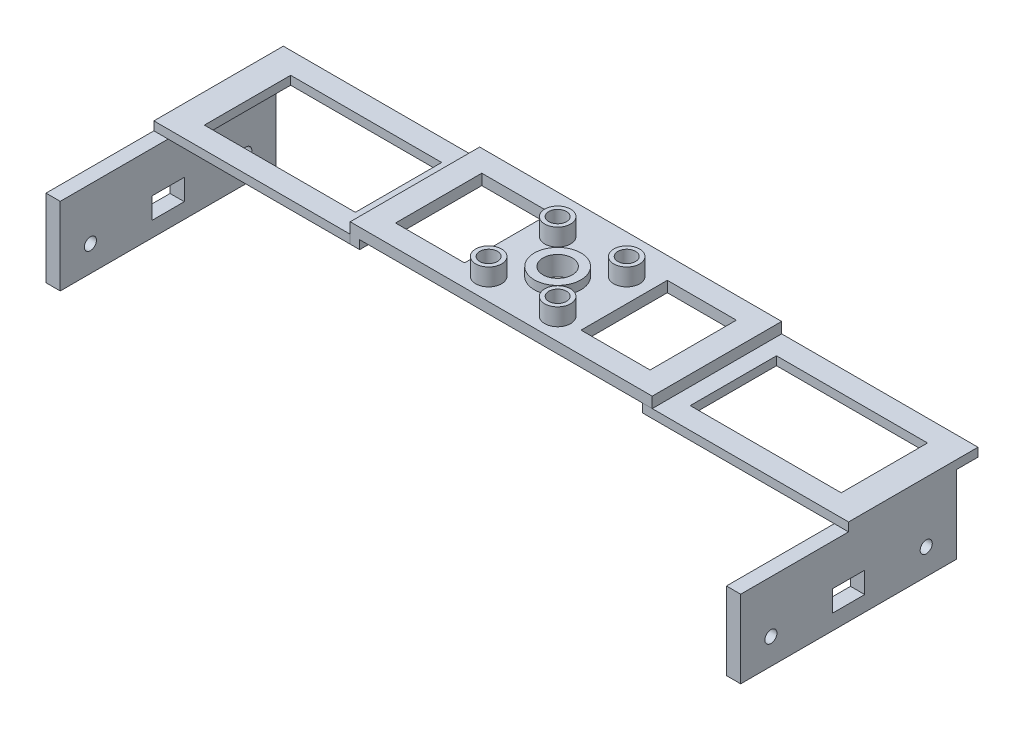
from build123d import *

# Parameters (mm, degrees)
EXTRUDE_1_DEPTH           = 7.5
SKETCH_8_R                = 4.4
CUT_EXTRUDE_2_DEPTH       = 1
SKETCH_9_R                = 3.4
CUT_EXTRUDE_3_DEPTH       = 8
SKETCH_17_R               = 3
SKETCH_17_R_2             = 2.05
EXTRUDE_4_DEPTH           = 4
EXTRUDE_START             = 1
SKETCH_18_R               = 5.4
SKETCH_18_R_2             = 4.4
EXTRUDE_5_DEPTH           = 1
SKETCH_42_W               = 63.432426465
SKETCH_42_H               = 12
CUT_EXTRUDE_15_DEPTH      = 10
SKETCH_43_W               = 2.2
SKETCH_43_H               = 30
EXTRUDE_21_DEPTH          = 10
SKETCH_44_W               = 30
SKETCH_44_H               = 2
EXTRUDE_22_DEPTH          = 45.5
SKETCH_45_W               = 30
SKETCH_45_H               = 2
EXTRUDE_23_DEPTH          = 45.5
SKETCH_46_W               = 2
SKETCH_46_H               = 50
EXTRUDE_24_DEPTH          = 18
CUT_EXTRUDE_16_DEPTH      = 168.794970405
CUT_EXTRUDE_16_DEPTH_BACK = 168.794970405
SKETCH_47_R               = 1.4
SKETCH_47_W               = 7.5
SKETCH_47_H               = 4.9
SKETCH_49_W               = 40
SKETCH_49_H               = 8.954531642
CUT_EXTRUDE_17_DEPTH      = 96.86788875
CUT_EXTRUDE_START         = -5
SKETCH_50_W               = 70
SKETCH_50_H               = 30
SKETCH_50_R               = 3
SKETCH_50_R_2             = 5.4
CUT_EXTRUDE_18_DEPTH      = 5
SKETCH_51_R               = 3
CUT_EXTRUDE_19_DEPTH      = 5
SKETCH_52_R               = 2.05
CUT_EXTRUDE_20_DEPTH      = 5
SKETCH_53_R               = 5.4
SKETCH_53_R_2             = 4.4
CUT_EXTRUDE_21_DEPTH      = 4
SKETCH_54_W               = 2.2
SKETCH_54_H               = 30
CUT_EXTRUDE_22_DEPTH      = 5
SKETCH_55_W               = 50
SKETCH_55_H               = 18
SKETCH_55_R               = 1.4
SKETCH_55_W_2             = 7.5
SKETCH_55_H_2             = 4.9
EXTRUDE_25_DEPTH          = 1.3
SKETCH_56_W               = 50
SKETCH_56_H               = 18
SKETCH_56_R               = 1.4
SKETCH_56_W_2             = 7.5
SKETCH_56_H_2             = 4.9
EXTRUDE_26_DEPTH          = 1.3
SKETCH_57_R               = 2.05
CUT_EXTRUDE_23_DEPTH      = 2
SKETCH_58_R               = 4.4
SKETCH_58_R_2             = 3.4
CUT_EXTRUDE_24_DEPTH      = 2
SKETCH_59_W               = 2.2
SKETCH_59_H               = 30
CUT_EXTRUDE_25_DEPTH      = 1
SKETCH_60_W               = 35
SKETCH_60_H               = 20
CUT_EXTRUDE_26_DEPTH      = 10
SKETCH_61_W               = 16
SKETCH_61_H               = 20
CUT_EXTRUDE_27_DEPTH      = 10


with BuildPart() as part:
    # Sketch 3 → Extrude 1 (new body)
    with BuildSketch(Plane(origin=(0, 0, 0), x_dir=(1, 0, 0), z_dir=(0, 1, 0))):
        with BuildLine():
            Line((-35, -13.08086256), (-20, -13.08086256))
            ThreePointArc((-20, -13.08086256), (0, -23.89788621), (20, -13.08086256))
            Line((20, -13.08086256), (35, -13.08086256))
            Line((35, -13.08086256), (35, 16.91913744))
            Line((35, 16.91913744), (-35, 16.91913744))
            Line((-35, 16.91913744), (-35, -13.08086256))
        make_face()
    extrude(amount=EXTRUDE_1_DEPTH)

    # Sketch 8 → Cut-Extrude 2 (cut)
    with BuildSketch(Plane(origin=(0, 7.5, 0), x_dir=(1, 0, 0), z_dir=(0, 1, 0))):
        with Locations(Location((0, 0, 0), (0, 0, 270))):
            Circle(SKETCH_8_R)
    extrude(amount=-CUT_EXTRUDE_2_DEPTH, mode=Mode.SUBTRACT)

    # Sketch 9 → Cut-Extrude 3 (cut)
    with BuildSketch(Plane(origin=(0, 6.5, 0), x_dir=(1, 0, 0), z_dir=(0, 1, 0))):
        with Locations(Location((0, 0, 0), (0, 0, 270))):
            Circle(SKETCH_9_R)
    extrude(amount=-CUT_EXTRUDE_3_DEPTH, mode=Mode.SUBTRACT)

    # Sketch 17 → Extrude 4 (add)
    # profile 1 of 4: a face of its own
    with BuildSketch(Plane(origin=(0, 7.5, 0), x_dir=(1, 0, 0), z_dir=(0, 1, 0))):
        with Locations(Location((-8, 8, 0), (0, 0, 270))):
            Circle(SKETCH_17_R)
        with Locations(Location((-8, 8, 0), (0, 0, 270))):
            Circle(SKETCH_17_R_2, mode=Mode.SUBTRACT)
    # profile 2 of 4: a face of its own
    with BuildSketch(Plane(origin=(0, 7.5, 0), x_dir=(1, 0, 0), z_dir=(0, 1, 0))):
        with Locations(Location((8, 8, 0), (0, 0, 270))):
            Circle(SKETCH_17_R)
        with Locations(Location((8, 8, 0), (0, 0, 270))):
            Circle(SKETCH_17_R_2, mode=Mode.SUBTRACT)
    # profile 3 of 4: a face of its own
    with BuildSketch(Plane(origin=(0, 7.5, 0), x_dir=(1, 0, 0), z_dir=(0, 1, 0))):
        with Locations(Location((-8, -8, 0), (0, 0, 270))):
            Circle(SKETCH_17_R)
        with Locations(Location((-8, -8, 0), (0, 0, 270))):
            Circle(SKETCH_17_R_2, mode=Mode.SUBTRACT)
    # profile 4 of 4: a face of its own
    with BuildSketch(Plane(origin=(0, 7.5, 0), x_dir=(1, 0, 0), z_dir=(0, 1, 0))):
        with Locations(Location((8, -8, 0), (0, 0, 270))):
            Circle(SKETCH_17_R)
        with Locations(Location((8, -8, 0), (0, 0, 270))):
            Circle(SKETCH_17_R_2, mode=Mode.SUBTRACT)
    extrude(amount=EXTRUDE_4_DEPTH)

    # Sketch 18 → Extrude 5 (add)
    with BuildSketch(Plane(origin=(0, 7.5, 0), x_dir=(1, 0, 0), z_dir=(0, 1, 0)).offset(EXTRUDE_START)):
        with Locations(Location((0, 0, 0), (0, 0, 270))):
            Circle(SKETCH_18_R)
        with Locations(Location((0, 0, 0), (0, 0, 270))):
            Circle(SKETCH_18_R_2, mode=Mode.SUBTRACT)
    extrude(amount=-EXTRUDE_5_DEPTH)

    # Sketch 42 → Cut-Extrude 15 (cut)
    with BuildSketch(Plane(origin=(0, 7.5, 0), x_dir=(1, 0, 0), z_dir=(0, 1, 0))):
        with Locations((1.880046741, -26.518154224)):
            Rectangle(SKETCH_42_W, SKETCH_42_H)
    extrude(amount=-CUT_EXTRUDE_15_DEPTH, mode=Mode.SUBTRACT)

    # Sketch 43 → Extrude 21 (add)
    with BuildSketch(Plane.XZ):
        with Locations((-33.9, -1.91913744)):
            Rectangle(SKETCH_43_W, SKETCH_43_H)
        with Locations((33.9, -1.91913744)):
            Rectangle(SKETCH_43_W, SKETCH_43_H)
    extrude(amount=EXTRUDE_21_DEPTH)

    # Sketch 44 → Extrude 22 (add)
    with BuildSketch(Plane.ZY.offset(35)):
        with Locations((-1.91913744, -9)):
            Rectangle(SKETCH_44_W, SKETCH_44_H)
    extrude(amount=EXTRUDE_22_DEPTH)

    # Sketch 45 → Extrude 23 (add)
    with BuildSketch(Plane(origin=(35, 0, 0), x_dir=(0, 0, -1), z_dir=(1, 0, 0))):
        with Locations((1.91913744, -9)):
            Rectangle(SKETCH_45_W, SKETCH_45_H)
    extrude(amount=EXTRUDE_23_DEPTH)

    # Sketch 46 → Extrude 24 (add)
    with BuildSketch(Plane.XZ.offset(10)):
        with Locations((-79.5, 13.08086256)):
            Rectangle(SKETCH_46_W, SKETCH_46_H)
        with Locations((79.5, 13.08086256)):
            Rectangle(SKETCH_46_W, SKETCH_46_H)
    extrude(amount=EXTRUDE_24_DEPTH)

    # Sketch 47 → Cut-Extrude 16 (cut, two sides: drawn at the far end of the back side and taken through both)
    with BuildSketch(Plane.ZY.offset(80.5).offset(-CUT_EXTRUDE_16_DEPTH_BACK)):
        with Locations((31.08086256, -22)):
            Circle(SKETCH_47_R)
        with Locations((-4.91913744, -22)):
            Circle(SKETCH_47_R)
        with Locations((13.08086256, -22)):
            Rectangle(SKETCH_47_W, SKETCH_47_H)
    extrude(amount=CUT_EXTRUDE_16_DEPTH + CUT_EXTRUDE_16_DEPTH_BACK, mode=Mode.SUBTRACT)

    # Sketch 49 → Cut-Extrude 17 (cut, through all)
    with BuildSketch(Plane(origin=(0, 7.5, 0), x_dir=(1, 0, 0), z_dir=(0, 1, 0))):
        with Locations((0, -17.558128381)):
            Rectangle(SKETCH_49_W, SKETCH_49_H)
    extrude(amount=-CUT_EXTRUDE_17_DEPTH, mode=Mode.SUBTRACT)

    # Sketch 50 → Cut-Extrude 18 (cut)
    with BuildSketch(Plane(origin=(0, 7.5, 0), x_dir=(1, 0, 0), z_dir=(0, 1, 0)).offset(CUT_EXTRUDE_START)):
        with Locations((0, 1.91913744)):
            Rectangle(SKETCH_50_W, SKETCH_50_H)
        with Locations(Location((-8, 8, 0), (0, 0, 270))):
            Circle(SKETCH_50_R, mode=Mode.SUBTRACT)
        with Locations(Location((-8, -8, 0), (0, 0, 270))):
            Circle(SKETCH_50_R, mode=Mode.SUBTRACT)
        with Locations(Location((0, 0, 0), (0, 0, 270))):
            Circle(SKETCH_50_R_2, mode=Mode.SUBTRACT)
        with Locations(Location((8, -8, 0), (0, 0, 270))):
            Circle(SKETCH_50_R, mode=Mode.SUBTRACT)
        with Locations(Location((8, 8, 0), (0, 0, 270))):
            Circle(SKETCH_50_R, mode=Mode.SUBTRACT)
    extrude(amount=CUT_EXTRUDE_18_DEPTH, mode=Mode.SUBTRACT)

    # Sketch 51 → Cut-Extrude 19 (cut)
    with BuildSketch(Plane(origin=(0, 11.5, 0), x_dir=(1, 0, 0), z_dir=(0, 1, 0)).offset(CUT_EXTRUDE_START)):
        with Locations(Location((-8, 8, 0), (0, 0, 270))):
            Circle(SKETCH_51_R)
        with Locations(Location((8, 8, 0), (0, 0, 270))):
            Circle(SKETCH_51_R)
        with Locations(Location((-8, -8, 0), (0, 0, 270))):
            Circle(SKETCH_51_R)
        with Locations(Location((8, -8, 0), (0, 0, 270))):
            Circle(SKETCH_51_R)
    extrude(amount=CUT_EXTRUDE_19_DEPTH, mode=Mode.SUBTRACT)

    # Sketch 52 → Cut-Extrude 20 (cut)
    with BuildSketch(Plane(origin=(0, 7.5, 0), x_dir=(1, 0, 0), z_dir=(0, 1, 0))):
        with Locations(Location((-8, -8, 0), (0, 0, 270))):
            Circle(SKETCH_52_R)
        with Locations(Location((-8, 8, 0), (0, 0, 270))):
            Circle(SKETCH_52_R)
        with Locations(Location((8, 8, 0), (0, 0, 270))):
            Circle(SKETCH_52_R)
        with Locations(Location((8, -8, 0), (0, 0, 270))):
            Circle(SKETCH_52_R)
    extrude(amount=-CUT_EXTRUDE_20_DEPTH, mode=Mode.SUBTRACT)

    # Sketch 53 → Cut-Extrude 21 (cut)
    with BuildSketch(Plane(origin=(0, 8.5, 0), x_dir=(1, 0, 0), z_dir=(0, 1, 0))):
        with Locations(Location((0, 0, 0), (0, 0, 270))):
            Circle(SKETCH_53_R)
        with Locations(Location((0, 0, 0), (0, 0, 270))):
            Circle(SKETCH_53_R_2, mode=Mode.SUBTRACT)
    extrude(amount=-CUT_EXTRUDE_21_DEPTH, mode=Mode.SUBTRACT)


with BuildPart() as body_2:
    # Split Bodies 1: the piece on the far side of the plane
    add(part.part)
    split(bisect_by=Plane.ZX.offset(-8), keep=Keep.BOTTOM)

    # Sketch 55 → Extrude 25 (add)
    with BuildSketch(Plane(origin=(-78.5, 0, 0), x_dir=(0, 0, -1), z_dir=(1, 0, 0))):
        with Locations((-13.08086256, -19)):
            Rectangle(SKETCH_55_W, SKETCH_55_H)
        with Locations(Location((-31.08086256, -22, 0), (0, 0, 180))):
            Circle(SKETCH_55_R, mode=Mode.SUBTRACT)
        with Locations(Location((4.91913744, -22, 0), (0, 0, 180))):
            Circle(SKETCH_55_R, mode=Mode.SUBTRACT)
        with Locations((-13.08086256, -22)):
            Rectangle(SKETCH_55_W_2, SKETCH_55_H_2, mode=Mode.SUBTRACT)
    extrude(amount=EXTRUDE_25_DEPTH)

    # Sketch 56 → Extrude 26 (add)
    with BuildSketch(Plane.ZY.offset(-78.5)):
        with Locations((13.08086256, -19)):
            Rectangle(SKETCH_56_W, SKETCH_56_H)
        with Locations((-4.91913744, -22)):
            Circle(SKETCH_56_R, mode=Mode.SUBTRACT)
        with Locations((31.08086256, -22)):
            Circle(SKETCH_56_R, mode=Mode.SUBTRACT)
        with Locations((13.08086256, -22)):
            Rectangle(SKETCH_56_W_2, SKETCH_56_H_2, mode=Mode.SUBTRACT)
    extrude(amount=EXTRUDE_26_DEPTH)

    # Sketch 60 → Cut-Extrude 26 (cut)
    with BuildSketch(Plane(origin=(0, -8, 0), x_dir=(1, 0, 0), z_dir=(0, 1, 0))):
        with Locations((56.3, 1.91913744)):
            Rectangle(SKETCH_60_W, SKETCH_60_H)
        with Locations((-56.3, 1.91913744)):
            Rectangle(SKETCH_60_W, SKETCH_60_H)
    extrude(amount=-CUT_EXTRUDE_26_DEPTH, mode=Mode.SUBTRACT)


with BuildPart() as part_1:
    add(part.part)

    # Split Bodies 1
    split(bisect_by=Plane.ZX.offset(-8), keep=Keep.TOP)

    # Sketch 54 → Cut-Extrude 22 (cut)
    with BuildSketch(Plane(origin=(0, -8, 0), x_dir=(1, 0, 0), z_dir=(0, 1, 0))):
        with Locations((-33.9, 1.91913744)):
            Rectangle(SKETCH_54_W, SKETCH_54_H)
        with Locations((33.9, 1.91913744)):
            Rectangle(SKETCH_54_W, SKETCH_54_H)
    extrude(amount=CUT_EXTRUDE_22_DEPTH, mode=Mode.SUBTRACT)


with BuildPart() as part_2:
    # Move Body 1: moved
    add(part_1.part.moved(Location((0, -8, 0))))

    # Sketch 57 → Cut-Extrude 23 (cut)
    with BuildSketch(Plane(origin=(0, -5.5, 0), x_dir=(1, 0, 0), z_dir=(0, 1, 0))):
        with Locations(Location((-8, -8, 0), (0, 0, 270))):
            Circle(SKETCH_57_R)
        with Locations(Location((8, -8, 0), (0, 0, 270))):
            Circle(SKETCH_57_R)
        with Locations(Location((8, 8, 0), (0, 0, 270))):
            Circle(SKETCH_57_R)
        with Locations(Location((-8, 8, 0), (0, 0, 270))):
            Circle(SKETCH_57_R)
    extrude(amount=-CUT_EXTRUDE_23_DEPTH, mode=Mode.SUBTRACT)

    # Sketch 58 → Cut-Extrude 24 (cut)
    with BuildSketch(Plane(origin=(0, -1.5, 0), x_dir=(1, 0, 0), z_dir=(0, 1, 0))):
        Circle(SKETCH_58_R)
        with Locations(Location((0, 0, 0), (0, 0, 270))):
            Circle(SKETCH_58_R_2, mode=Mode.SUBTRACT)
    extrude(amount=-CUT_EXTRUDE_24_DEPTH, mode=Mode.SUBTRACT)

    # Sketch 59 → Cut-Extrude 25 (cut)
    with BuildSketch(Plane.XZ.offset(11)):
        with Locations((-33.9, -1.91913744)):
            Rectangle(SKETCH_59_W, SKETCH_59_H)
        with Locations((33.9, -1.91913744)):
            Rectangle(SKETCH_59_W, SKETCH_59_H)
    extrude(amount=-CUT_EXTRUDE_25_DEPTH, mode=Mode.SUBTRACT)

    # Sketch 61 → Cut-Extrude 27 (cut)
    with BuildSketch(Plane(origin=(0, -5.5, 0), x_dir=(1, 0, 0), z_dir=(0, 1, 0))):
        with Locations((-21.5, 1.91913744)):
            Rectangle(SKETCH_61_W, SKETCH_61_H)
        with Locations((21.5, 1.91913744)):
            Rectangle(SKETCH_61_W, SKETCH_61_H)
    extrude(amount=-CUT_EXTRUDE_27_DEPTH, mode=Mode.SUBTRACT)


solid = Compound([body_2.part, part_2.part])
